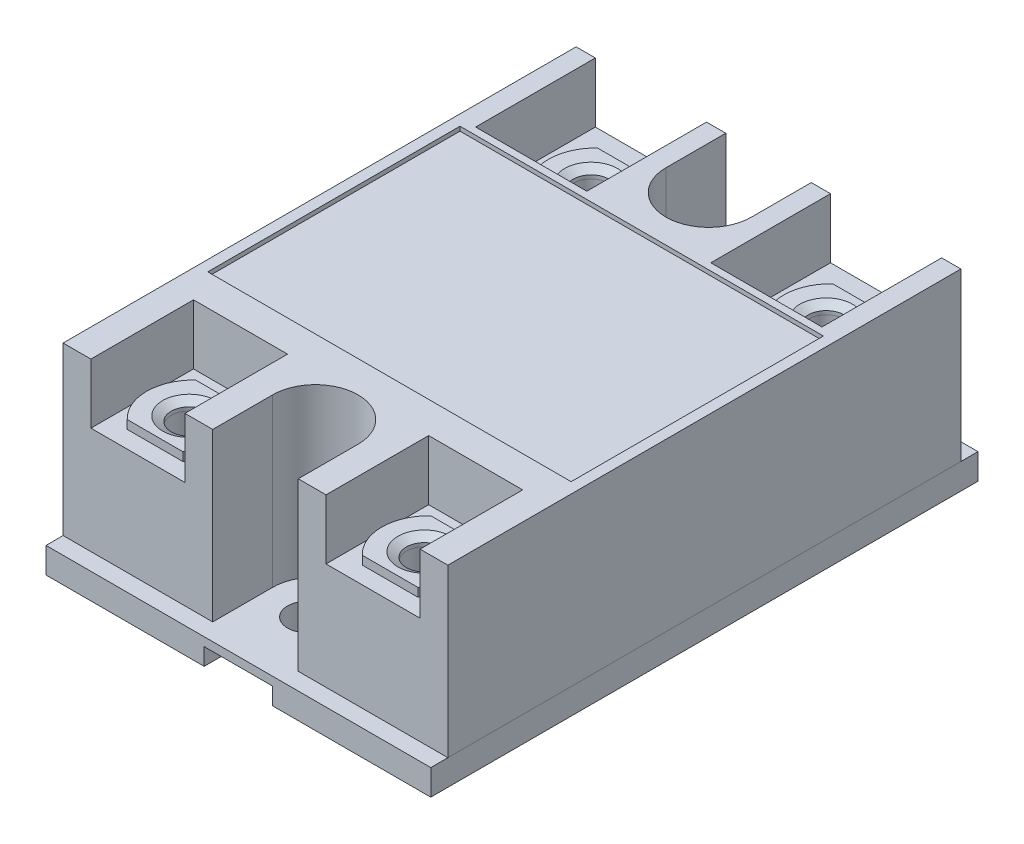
from build123d import *

# Parameters (mm, degrees)
BOSS_EXTRUDE1_DEPTH  = 19.5
SKETCH2_W            = 11
SKETCH2_H            = 12
SKETCH2_W_2          = 13
SKETCH2_H_2          = 14
CUT_EXTRUDE1_DEPTH   = 7
SKETCH6_W            = 45
SKETCH6_H            = 64
SKETCH6_R            = 2.25
BOSS_EXTRUDE2_DEPTH  = 3
SKETCH7_W            = 42.5
SKETCH7_H            = 29.5
CUT_EXTRUDE2_DEPTH   = 0.5
LPATTERN1_COUNT      = 2
LPATTERN1_PITCH      = 27.5
LPATTERN1_COUNT_DIR2 = 2
LPATTERN1_PITCH_DIR2 = 47
SKETCH14_R           = 2.1
BOSS_EXTRUDE3_DEPTH  = 1
CHAMFER1_SIZE        = 1
CHAMFER1_SIZE2       = 0.577350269
LPATTERN2_COUNT      = 2
LPATTERN2_PITCH      = 27.5
LPATTERN2_2_COUNT    = 2
LPATTERN2_2_PITCH    = 47
SKETCH15_W           = 8
SKETCH15_H           = 3
CUT_EXTRUDE3_DEPTH   = 2


with BuildPart() as part:
    # Sketch1 → Boss-Extrude1 (new body)
    with BuildSketch(Plane(origin=(0, 0, 0), x_dir=(1, 0, 0), z_dir=(0, 1, 0))):
        with BuildLine():
            Line((0, 0), (0, 60))
            Line((0, 60), (17.5, 60))
            Line((17.5, 60), (17.5, 53))
            ThreePointArc((17.5, 53), (22.5, 48), (27.5, 53))
            Line((27.5, 53), (27.5, 60))
            Line((27.5, 60), (45, 60))
            Line((45, 60), (45, 0))
            Line((45, 0), (27.5, 0))
            Line((27.5, 0), (27.5, 7))
            ThreePointArc((27.5, 7), (22.5, 12), (17.5, 7))
            Line((17.5, 7), (17.5, 0))
            Line((17.5, 0), (0, 0))
        make_face()
    extrude(amount=BOSS_EXTRUDE1_DEPTH)

    # Sketch2 → Cut-Extrude1 (cut)
    with BuildSketch(Plane(origin=(0, 19.5, 0), x_dir=(1, 0, 0), z_dir=(0, 1, 0))):
        with Locations((8.75, 6)):
            Rectangle(SKETCH2_W, SKETCH2_H)
        with Locations((36.25, 6)):
            Rectangle(SKETCH2_W, SKETCH2_H)
        with Locations((8.75, 53)):
            Rectangle(SKETCH2_W_2, SKETCH2_H_2)
        with Locations((36.25, 53)):
            Rectangle(SKETCH2_W_2, SKETCH2_H_2)
    extrude(amount=-CUT_EXTRUDE1_DEPTH, mode=Mode.SUBTRACT)

    # Sketch7 → Cut-Extrude2 (cut)
    with BuildSketch(Plane(origin=(0, 19.5, 0), x_dir=(1, 0, 0), z_dir=(0, 1, 0))):
        with Locations((22.5, 30.417585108)):
            Rectangle(SKETCH7_W, SKETCH7_H)
    extrude(amount=-CUT_EXTRUDE2_DEPTH, mode=Mode.SUBTRACT)

    # Sketch12 → M5x0.8 Tapped Hole1 (revolve, cut)
    with BuildSketch(Plane(origin=(36.25, 12.5, -6), x_dir=(0, 0, 1), z_dir=(1, 0, 0))):
        Polygon((0, 0), (0, 15.2618073), (2.1, 14), (2.1, 0), align=None)
    m5x0_8_tapped_hole1 = revolve(axis=Axis((36.25, 18.85, -6), (0, -1, 0)), mode=Mode.SUBTRACT)


with BuildPart() as body_2:
    # Sketch6 → Boss-Extrude2 (new body)
    with BuildSketch(Plane(origin=(0, 0, 0), x_dir=(1, 0, 0), z_dir=(0, 1, 0))):
        with Locations((22.5, 30)):
            Rectangle(SKETCH6_W, SKETCH6_H)
        with Locations(Location((22.5, 6, 0), (0, 0, 270))):
            Circle(SKETCH6_R, mode=Mode.SUBTRACT)
        with BuildLine():
            Line((24.75, 55.5), (24.75, 54))
            ThreePointArc((24.75, 54), (22.5, 51.75), (20.25, 54))
            Line((20.25, 54), (20.25, 55.5))
            ThreePointArc((20.25, 55.5), (22.5, 57.75), (24.75, 55.5))
        make_face(mode=Mode.SUBTRACT)
    extrude(amount=-BOSS_EXTRUDE2_DEPTH)


with BuildPart() as lpattern1_tool:
    # LPattern1: M5x0.8 Tapped Hole1 2 × 2
    with Locations(*[(-i * LPATTERN1_PITCH, 0, -j * LPATTERN1_PITCH_DIR2) for i in range(LPATTERN1_COUNT) for j in range(LPATTERN1_COUNT_DIR2) if (i, j) != (0, 0)]):
        add(m5x0_8_tapped_hole1)


with BuildPart() as part_1:
    add(part.part)

    # LPattern1: cut by lpattern1_tool
    add(lpattern1_tool.part, mode=Mode.SUBTRACT)


with BuildPart() as body_2_1:
    add(body_2.part)

    # LPattern1: cut by lpattern1_tool
    add(lpattern1_tool.part, mode=Mode.SUBTRACT)

    # Sketch15 → Cut-Extrude3 (cut)
    with BuildSketch(Plane.XZ.offset(3)):
        with Locations((22.5, 0.5)):
            Rectangle(SKETCH15_W, SKETCH15_H)
        with Locations((22.5, -60.5)):
            Rectangle(SKETCH15_W, SKETCH15_H)
    extrude(amount=-CUT_EXTRUDE3_DEPTH, mode=Mode.SUBTRACT)


with BuildPart() as body_3:
    # Sketch14 → Boss-Extrude3 (new body)
    with BuildSketch(Plane(origin=(0, 12.5, 0), x_dir=(1, 0, 0), z_dir=(0, 1, 0))):
        with BuildLine():
            Line((5.5, 10), (12, 10))
            ThreePointArc((12, 10), (13.725082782, 6), (12, 2))
            Line((12, 2), (5.5, 2))
            ThreePointArc((5.5, 2), (3.774917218, 6), (5.5, 10))
        make_face()
        with Locations(Location((8.75, 6, 0), (0, 0, 270))):
            Circle(SKETCH14_R, mode=Mode.SUBTRACT)
    extrude(amount=BOSS_EXTRUDE3_DEPTH)

    # Chamfer1
    chamfer1_edges = [body_3.edges().sort_by_distance(p)[0] for p in [
        (8.75, 13.5, -8.1),
    ]]
    chamfer1_side = [body_3.faces().sort_by_distance(p)[0] for p in [
        (13.59740906, 13.5, -6),
    ]]
    chamfer(chamfer1_edges, length=CHAMFER1_SIZE, length2=CHAMFER1_SIZE2, reference=chamfer1_side[0])


with BuildPart() as lpattern2_1:
    # LPattern2: pattern copy
    add(body_3.part.moved(Location(Vector(1, 0, 0) * (1 * LPATTERN2_PITCH))))


with BuildPart() as lpattern2_2_1:
    # LPattern2 2: pattern copy
    add(body_3.part.moved(Location(Vector(0, 0, -1) * (1 * LPATTERN2_2_PITCH))))


with BuildPart() as lpattern2_2_2:
    # LPattern2 2: pattern copy
    add(lpattern2_1.part.moved(Location(Vector(0, 0, -1) * (1 * LPATTERN2_2_PITCH))))


solid = Compound([part_1.part, body_2_1.part, body_3.part, lpattern2_1.part, lpattern2_2_1.part, lpattern2_2_2.part])
